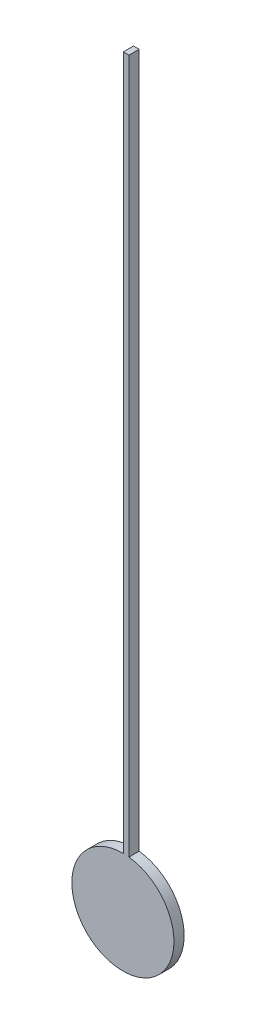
from build123d import *

# Parameters (mm, degrees)
LINEAR_AUSTRAGEN1_DEPTH = 1


with BuildPart() as part:
    # Skizze1 → Linear austragen1 (new body)
    with BuildSketch(Plane.XY):
        with BuildLine():
            Line((0.038273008, 4.999853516), (0.038273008, 72.984552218))
            Line((0.038273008, 72.984552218), (0.592712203, 72.984552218))
            Line((0.592712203, 72.984552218), (0.592712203, 4.964744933))
            ThreePointArc((0.592712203, 4.964744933), (-0.315980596, -4.990005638), (0.038273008, 4.999853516))
        make_face()
    extrude(amount=LINEAR_AUSTRAGEN1_DEPTH)


solid = part.part
